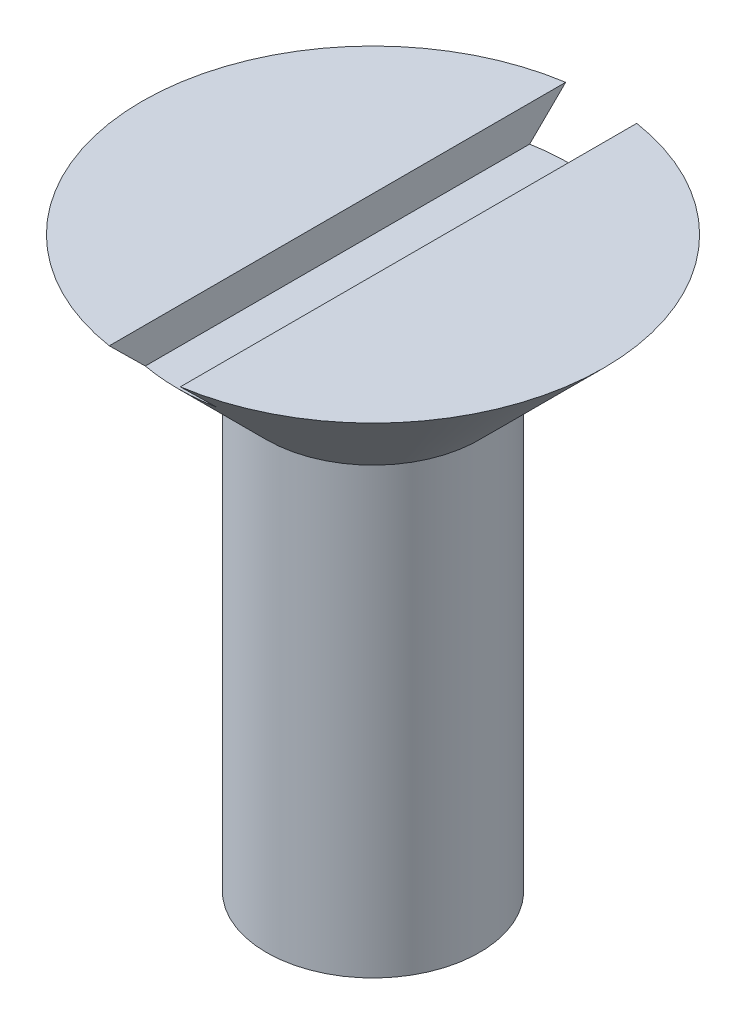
from build123d import *

# Parameters (mm, degrees)
CUT_EXTRUDE1_DEPTH      = 20.973122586
CUT_EXTRUDE1_DEPTH_BACK = 20.973122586
SKETCH2_W               = 2
SKETCH2_H               = 1


with BuildPart() as part:
    # Sketch1 → Revolve1 (revolve)
    with BuildSketch(Plane.XY, mode=Mode.PRIVATE) as revolve1_sk:
        Polygon((0, 0), (6.5, 0), (3, -3.5), (3, -16), (0, -17.732050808), align=None)
    revolve(revolve1_sk.sketch.rotate(Axis((0, 0, 0), (0, -1, 0)), 90), axis=Axis((0, 0, 0), (0, -1, 0)))

    # Sketch2 → Cut-Extrude1 (cut, two sides: drawn at the far end of the back side and taken through both)
    with BuildSketch(Plane.XY.offset(-CUT_EXTRUDE1_DEPTH_BACK)):
        with Locations((0, -0.5)):
            Rectangle(SKETCH2_W, SKETCH2_H)
    extrude(amount=CUT_EXTRUDE1_DEPTH + CUT_EXTRUDE1_DEPTH_BACK, mode=Mode.SUBTRACT)


solid = part.part
